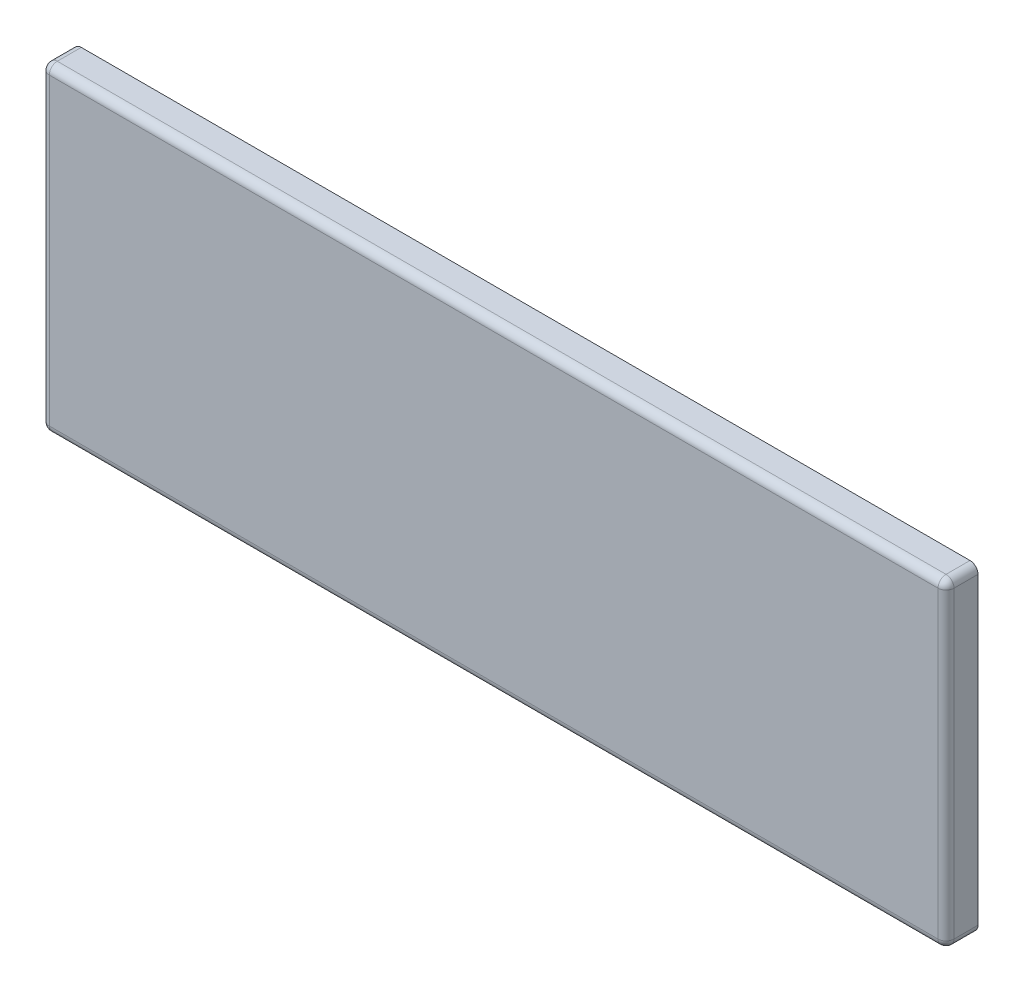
from build123d import *

# Parameters (mm, degrees)
CROQUIS1_W     = 113.14
CROQUIS1_H     = 40
EXTRUIR5_DEPTH = 4
REDONDEO1_R    = 1


with BuildPart() as part:
    # Croquis1 → Extruir5 (new body)
    with BuildSketch(Plane.XY):
        Rectangle(CROQUIS1_W, CROQUIS1_H)
    extrude(amount=EXTRUIR5_DEPTH)

    # Redondeo1
    redondeo1_edges = [part.edges().sort_by_distance(p)[0] for p in [
        (-56.57, 0, 4),
        (0, -20, 4),
        (56.57, 0, 4),
        (0, 20, 4),
        (56.57, -20, 2),
        (-56.57, -20, 2),
        (-56.57, 20, 2),
        (56.57, 20, 2),
    ]]
    fillet(redondeo1_edges, radius=REDONDEO1_R)


solid = part.part
